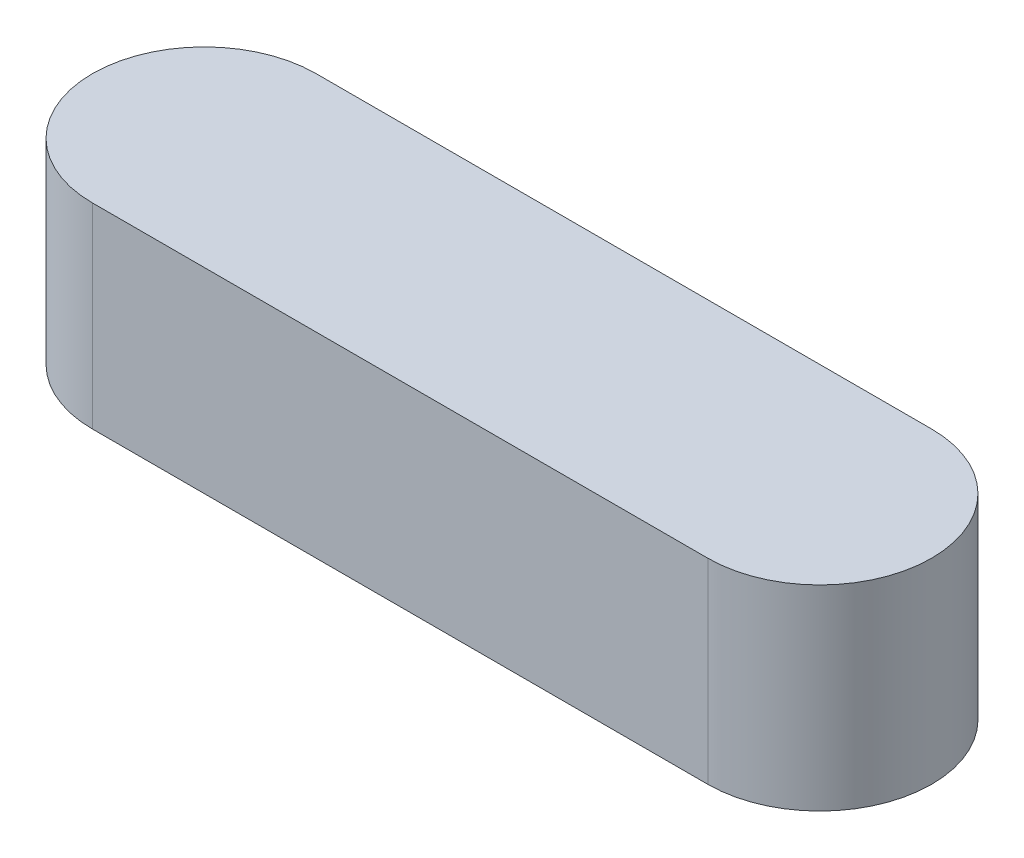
from build123d import *

# Parameters (mm, degrees)
BASE_EXTRUSION_DEPTH = 7


with BuildPart() as part:
    # Esquisse1 → Base-Extrusion (new body)
    with BuildSketch(Plane(origin=(0, 0, 0), x_dir=(1, 0, 0), z_dir=(0, 1, 0))):
        with BuildLine():
            Line((0, 4), (22, 4))
            ThreePointArc((22, 4), (26, 0), (22, -4))
            Line((22, -4), (0, -4))
            ThreePointArc((0, -4), (-4, 0), (0, 4))
        make_face()
    extrude(amount=BASE_EXTRUSION_DEPTH)


solid = part.part
